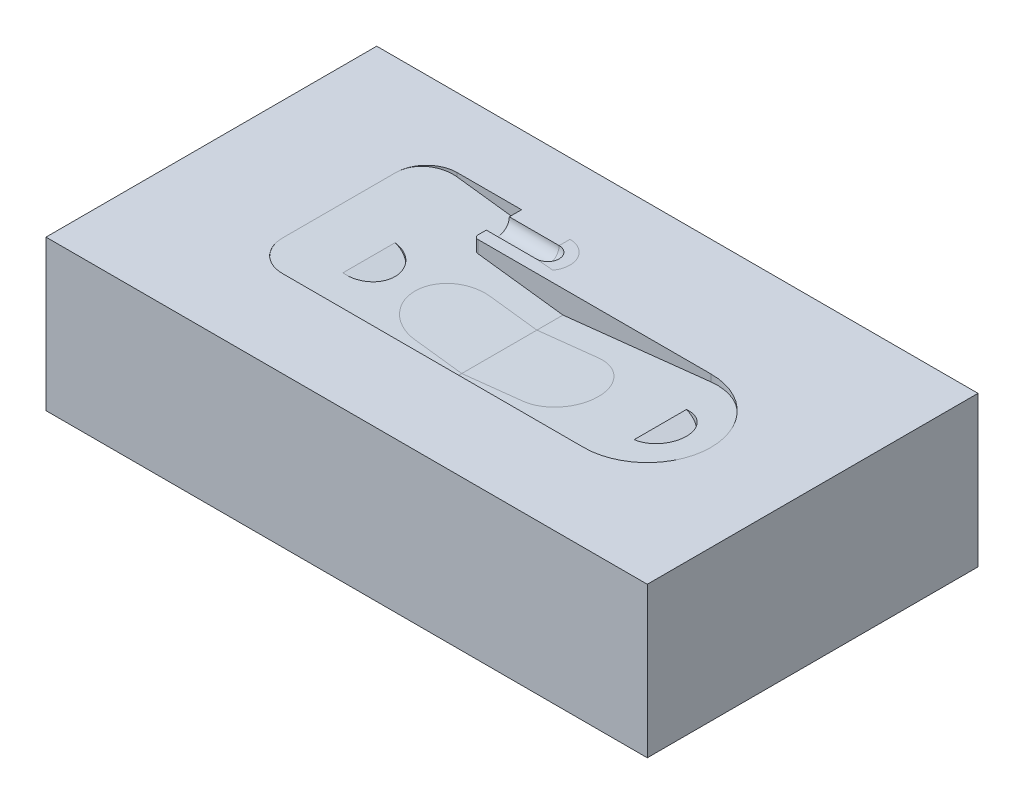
ISO-10303-21;
HEADER;
FILE_DESCRIPTION(('STEP AP214'),'2;1');
FILE_NAME('part.step','',(''),(''),'','','');
FILE_SCHEMA(('AUTOMOTIVE_DESIGN { 1 0 10303 214 1 1 1 1 }'));
ENDSEC;
DATA;
#1=APPLICATION_CONTEXT('core data for automotive mechanical design processes');
#2=APPLICATION_PROTOCOL_DEFINITION('international standard','automotive_design',2000,#1);
#3=PRODUCT_CONTEXT('',#1,'mechanical');
#4=PRODUCT('Part','Part','',(#3));
#5=PRODUCT_RELATED_PRODUCT_CATEGORY('part','',(#4));
#6=PRODUCT_DEFINITION_FORMATION('','',#4);
#7=PRODUCT_DEFINITION_CONTEXT('part definition',#1,'design');
#8=PRODUCT_DEFINITION('design','',#6,#7);
#9=PRODUCT_DEFINITION_SHAPE('','',#8);
#10=(LENGTH_UNIT() NAMED_UNIT(*) SI_UNIT(.MILLI.,.METRE.));
#11=(NAMED_UNIT(*) PLANE_ANGLE_UNIT() SI_UNIT($,.RADIAN.));
#12=(NAMED_UNIT(*) SI_UNIT($,.STERADIAN.) SOLID_ANGLE_UNIT());
#13=UNCERTAINTY_MEASURE_WITH_UNIT(LENGTH_MEASURE(1.E-05),#10,'distance_accuracy_value','');
#14=(GEOMETRIC_REPRESENTATION_CONTEXT(3) GLOBAL_UNCERTAINTY_ASSIGNED_CONTEXT((#13)) GLOBAL_UNIT_ASSIGNED_CONTEXT((#10,
#11,#12)) REPRESENTATION_CONTEXT('',''));
#15=CARTESIAN_POINT('',(0.,0.,0.));
#16=DIRECTION('',(0.,0.,1.));
#17=DIRECTION('',(1.,0.,0.));
#18=AXIS2_PLACEMENT_3D('',#15,#16,#17);
#19=CARTESIAN_POINT('',(0.867000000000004,-10.3658695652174,38.9801952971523));
#20=DIRECTION('',(0.352958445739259,0.935638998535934,0.));
#21=DIRECTION('',(-0.935638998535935,0.352958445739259,0.));
#22=AXIS2_PLACEMENT_3D('',#19,#20,#21);
#23=PLANE('',#22);
#24=CARTESIAN_POINT('',(0.867000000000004,-10.3658695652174,0.));
#25=DIRECTION('',(0.352958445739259,0.935638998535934,0.));
#26=DIRECTION('',(0.935638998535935,-0.352958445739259,0.));
#27=AXIS2_PLACEMENT_3D('',#24,#25,#26);
#28=ELLIPSE('',#27,1.85327888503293,1.734);
#29=CARTESIAN_POINT('',(0.867000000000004,-10.3658695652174,1.73400000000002));
#30=VERTEX_POINT('',#29);
#31=CARTESIAN_POINT('',(0.867000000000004,-10.3658695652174,-1.73399999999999));
#32=VERTEX_POINT('',#31);
#33=EDGE_CURVE('E400',#30,#32,#28,.T.);
#34=ORIENTED_EDGE('',*,*,#33,.T.);
#35=DIRECTION('',(0.,0.,-1.));
#36=VECTOR('',#35,1.);
#37=CARTESIAN_POINT('',(0.867000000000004,-10.3658695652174,38.9801952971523));
#38=LINE('',#37,#36);
#39=EDGE_CURVE('E397',#30,#32,#38,.T.);
#40=ORIENTED_EDGE('',*,*,#39,.F.);
#41=EDGE_LOOP('',(#34,#40));
#42=FACE_BOUND('',#41,.T.);
#43=ADVANCED_FACE('F30',(#42),#23,.T.);
#44=CARTESIAN_POINT('',(0.867000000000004,-7.96,0.));
#45=DIRECTION('',(0.,-1.,0.));
#46=DIRECTION('',(0.,0.,-1.));
#47=AXIS2_PLACEMENT_3D('',#44,#45,#46);
#48=CYLINDRICAL_SURFACE('',#47,1.734);
#49=CARTESIAN_POINT('',(0.867000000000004,-10.3658695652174,0.));
#50=DIRECTION('',(0.108059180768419,-0.994144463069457,0.));
#51=DIRECTION('',(-0.994144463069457,-0.108059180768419,0.));
#52=AXIS2_PLACEMENT_3D('',#49,#50,#51);
#53=ELLIPSE('',#52,1.74421330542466,1.734);
#54=EDGE_CURVE('E377',#30,#32,#53,.F.);
#55=ORIENTED_EDGE('',*,*,#54,.T.);
#56=ORIENTED_EDGE('',*,*,#33,.F.);
#57=EDGE_LOOP('',(#55,#56));
#58=FACE_BOUND('',#57,.T.);
#59=ADVANCED_FACE('F760',(#58),#48,.F.);
#60=CARTESIAN_POINT('',(-18.513,-7.96,0.));
#61=DIRECTION('',(0.,-1.,0.));
#62=DIRECTION('',(0.,0.,-1.));
#63=AXIS2_PLACEMENT_3D('',#60,#61,#62);
#64=CYLINDRICAL_SURFACE('',#63,1.734);
#65=CARTESIAN_POINT('',(-18.513,-10.44625,0.));
#66=DIRECTION('',(-0.124034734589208,-0.992277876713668,0.));
#67=DIRECTION('',(0.992277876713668,-0.124034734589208,0.));
#68=AXIS2_PLACEMENT_3D('',#65,#66,#67);
#69=ELLIPSE('',#68,1.74749436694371,1.734);
#70=CARTESIAN_POINT('',(-18.513,-10.44625,1.734));
#71=VERTEX_POINT('',#70);
#72=CARTESIAN_POINT('',(-18.513,-10.44625,-1.73399999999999));
#73=VERTEX_POINT('',#72);
#74=EDGE_CURVE('E369',#71,#73,#69,.F.);
#75=ORIENTED_EDGE('',*,*,#74,.T.);
#76=CARTESIAN_POINT('',(-18.513,-10.44625,0.));
#77=DIRECTION('',(-0.314132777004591,-0.949379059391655,0.));
#78=DIRECTION('',(0.949379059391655,-0.314132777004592,0.));
#79=AXIS2_PLACEMENT_3D('',#76,#77,#78);
#80=ELLIPSE('',#79,1.82645696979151,1.734);
#81=EDGE_CURVE('E420',#73,#71,#80,.T.);
#82=ORIENTED_EDGE('',*,*,#81,.T.);
#83=EDGE_LOOP('',(#75,#82));
#84=FACE_BOUND('',#83,.T.);
#85=ADVANCED_FACE('F757',(#84),#64,.F.);
#86=CARTESIAN_POINT('',(-16.779,-11.02,38.4064452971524));
#87=DIRECTION('',(-0.314132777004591,-0.949379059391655,0.));
#88=DIRECTION('',(0.949379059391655,-0.314132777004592,0.));
#89=AXIS2_PLACEMENT_3D('',#86,#87,#88);
#90=PLANE('',#89);
#91=ORIENTED_EDGE('',*,*,#81,.F.);
#92=DIRECTION('',(0.,0.,-1.));
#93=VECTOR('',#92,1.);
#94=CARTESIAN_POINT('',(-18.513,-10.44625,38.4064452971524));
#95=LINE('',#94,#93);
#96=EDGE_CURVE('E159',#71,#73,#95,.T.);
#97=ORIENTED_EDGE('',*,*,#96,.F.);
#98=EDGE_LOOP('',(#91,#97));
#99=FACE_BOUND('',#98,.T.);
#100=ADVANCED_FACE('F753',(#99),#90,.F.);
#101=CARTESIAN_POINT('',(-15.504,-8.47,-4.488));
#102=DIRECTION('',(0.,-1.,0.));
#103=DIRECTION('',(0.,0.,-1.));
#104=AXIS2_PLACEMENT_3D('',#101,#102,#103);
#105=CYLINDRICAL_SURFACE('',#104,0.255);
#106=CARTESIAN_POINT('',(-15.504,-10.,-4.488));
#107=DIRECTION('',(0.,-1.,0.));
#108=DIRECTION('',(0.,0.,1.));
#109=AXIS2_PLACEMENT_3D('',#106,#107,#108);
#110=CIRCLE('',#109,0.255);
#111=CARTESIAN_POINT('',(-15.504,-10.,-4.233));
#112=VERTEX_POINT('',#111);
#113=CARTESIAN_POINT('',(-15.759,-10.,-4.488));
#114=VERTEX_POINT('',#113);
#115=EDGE_CURVE('E431',#112,#114,#110,.T.);
#116=ORIENTED_EDGE('',*,*,#115,.T.);
#117=DIRECTION('',(0.,-1.,0.));
#118=VECTOR('',#117,1.);
#119=CARTESIAN_POINT('',(-15.759,-8.47,-4.488));
#120=LINE('',#119,#118);
#121=CARTESIAN_POINT('',(-15.759,-10.7905,-4.488));
#122=VERTEX_POINT('',#121);
#123=EDGE_CURVE('E447',#114,#122,#120,.T.);
#124=ORIENTED_EDGE('',*,*,#123,.T.);
#125=CARTESIAN_POINT('',(-15.504,-10.822375,-4.488));
#126=DIRECTION('',(-0.124034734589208,-0.992277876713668,0.));
#127=DIRECTION('',(0.992277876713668,-0.124034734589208,0.));
#128=AXIS2_PLACEMENT_3D('',#125,#126,#127);
#129=ELLIPSE('',#128,0.256984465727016,0.255);
#130=CARTESIAN_POINT('',(-15.504,-10.822375,-4.233));
#131=VERTEX_POINT('',#130);
#132=EDGE_CURVE('E374',#122,#131,#129,.F.);
#133=ORIENTED_EDGE('',*,*,#132,.T.);
#134=DIRECTION('',(0.,-1.,0.));
#135=VECTOR('',#134,1.);
#136=CARTESIAN_POINT('',(-15.504,-8.47,-4.233));
#137=LINE('',#136,#135);
#138=EDGE_CURVE('E419',#112,#131,#137,.T.);
#139=ORIENTED_EDGE('',*,*,#138,.F.);
#140=EDGE_LOOP('',(#116,#124,#133,#139));
#141=FACE_BOUND('',#140,.T.);
#142=ADVANCED_FACE('F750',(#141),#105,.T.);
#143=CARTESIAN_POINT('',(-12.444,-10.,-5.814));
#144=DIRECTION('',(0.,0.,1.));
#145=DIRECTION('',(1.,0.,0.));
#146=AXIS2_PLACEMENT_3D('',#143,#144,#145);
#147=SPHERICAL_SURFACE('',#146,0.765);
#148=CARTESIAN_POINT('',(-12.444,-10.,-5.814));
#149=DIRECTION('',(-1.,0.,0.));
#150=DIRECTION('',(0.,0.,1.));
#151=AXIS2_PLACEMENT_3D('',#148,#149,#150);
#152=CIRCLE('',#151,0.765000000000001);
#153=CARTESIAN_POINT('',(-12.444,-10.,-6.579));
#154=VERTEX_POINT('',#153);
#155=CARTESIAN_POINT('',(-12.444,-10.,-5.049));
#156=VERTEX_POINT('',#155);
#157=EDGE_CURVE('E451',#154,#156,#152,.T.);
#158=ORIENTED_EDGE('',*,*,#157,.T.);
#159=CARTESIAN_POINT('',(-12.444,-10.,-5.814));
#160=DIRECTION('',(0.,-1.,0.));
#161=DIRECTION('',(0.,0.,-1.));
#162=AXIS2_PLACEMENT_3D('',#159,#160,#161);
#163=CIRCLE('',#162,0.765);
#164=EDGE_CURVE('E50',#154,#156,#163,.T.);
#165=ORIENTED_EDGE('',*,*,#164,.F.);
#166=EDGE_LOOP('',(#158,#165));
#167=FACE_BOUND('',#166,.T.);
#168=ADVANCED_FACE('F747',(#167),#147,.F.);
#169=CARTESIAN_POINT('',(-11.679,-10.,-5.814));
#170=DIRECTION('',(-1.,0.,0.));
#171=DIRECTION('',(0.,0.,1.));
#172=AXIS2_PLACEMENT_3D('',#169,#170,#171);
#173=CYLINDRICAL_SURFACE('',#172,0.765000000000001);
#174=DIRECTION('',(1.,0.,0.));
#175=VECTOR('',#174,1.);
#176=CARTESIAN_POINT('',(-11.679,-10.,-5.049));
#177=LINE('',#176,#175);
#178=CARTESIAN_POINT('',(-15.759,-10.,-5.049));
#179=VERTEX_POINT('',#178);
#180=EDGE_CURVE('E65',#179,#156,#177,.T.);
#181=ORIENTED_EDGE('',*,*,#180,.T.);
#182=ORIENTED_EDGE('',*,*,#157,.F.);
#183=DIRECTION('',(-1.,0.,0.));
#184=VECTOR('',#183,1.);
#185=CARTESIAN_POINT('',(-11.679,-10.,-6.579));
#186=LINE('',#185,#184);
#187=CARTESIAN_POINT('',(-15.759,-10.,-6.579));
#188=VERTEX_POINT('',#187);
#189=EDGE_CURVE('E454',#154,#188,#186,.T.);
#190=ORIENTED_EDGE('',*,*,#189,.T.);
#191=CARTESIAN_POINT('',(-15.759,-10.,-5.814));
#192=DIRECTION('',(-1.,0.,0.));
#193=DIRECTION('',(0.,0.,1.));
#194=AXIS2_PLACEMENT_3D('',#191,#192,#193);
#195=CIRCLE('',#194,0.765000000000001);
#196=EDGE_CURVE('E460',#179,#188,#195,.F.);
#197=ORIENTED_EDGE('',*,*,#196,.F.);
#198=EDGE_LOOP('',(#181,#182,#190,#197));
#199=FACE_BOUND('',#198,.T.);
#200=ADVANCED_FACE('F744',(#199),#173,.F.);
#201=CARTESIAN_POINT('',(-15.759,-8.47,-7.395));
#202=DIRECTION('',(-1.,0.,0.));
#203=DIRECTION('',(0.,0.,1.));
#204=AXIS2_PLACEMENT_3D('',#201,#202,#203);
#205=PLANE('',#204);
#206=DIRECTION('',(0.,0.,-1.));
#207=VECTOR('',#206,1.);
#208=CARTESIAN_POINT('',(-15.759,-10.,-7.395));
#209=LINE('',#208,#207);
#210=CARTESIAN_POINT('',(-15.759,-10.,-7.395));
#211=VERTEX_POINT('',#210);
#212=EDGE_CURVE('E86',#188,#211,#209,.T.);
#213=ORIENTED_EDGE('',*,*,#212,.T.);
#214=DIRECTION('',(0.,-1.,0.));
#215=VECTOR('',#214,1.);
#216=CARTESIAN_POINT('',(-15.759,-8.47,-7.395));
#217=LINE('',#216,#215);
#218=CARTESIAN_POINT('',(-15.759,-10.7905,-7.395));
#219=VERTEX_POINT('',#218);
#220=EDGE_CURVE('E450',#211,#219,#217,.T.);
#221=ORIENTED_EDGE('',*,*,#220,.T.);
#222=DIRECTION('',(0.,0.,1.));
#223=VECTOR('',#222,1.);
#224=CARTESIAN_POINT('',(-15.759,-10.7905,-7.395));
#225=LINE('',#224,#223);
#226=EDGE_CURVE('E165',#219,#122,#225,.T.);
#227=ORIENTED_EDGE('',*,*,#226,.T.);
#228=ORIENTED_EDGE('',*,*,#123,.F.);
#229=DIRECTION('',(0.,0.,-1.));
#230=VECTOR('',#229,1.);
#231=CARTESIAN_POINT('',(-15.759,-10.,-7.395));
#232=LINE('',#231,#230);
#233=EDGE_CURVE('E77',#114,#179,#232,.T.);
#234=ORIENTED_EDGE('',*,*,#233,.T.);
#235=ORIENTED_EDGE('',*,*,#196,.T.);
#236=EDGE_LOOP('',(#213,#221,#227,#228,#234,#235));
#237=FACE_BOUND('',#236,.T.);
#238=ADVANCED_FACE('F741',(#237),#205,.T.);
#239=CARTESIAN_POINT('',(-20.043,-8.47,-7.395));
#240=DIRECTION('',(0.,0.,1.));
#241=DIRECTION('',(1.,0.,0.));
#242=AXIS2_PLACEMENT_3D('',#239,#240,#241);
#243=PLANE('',#242);
#244=DIRECTION('',(-1.,0.,0.));
#245=VECTOR('',#244,1.);
#246=CARTESIAN_POINT('',(-20.043,-10.,-7.395));
#247=LINE('',#246,#245);
#248=CARTESIAN_POINT('',(-20.043,-10.,-7.395));
#249=VERTEX_POINT('',#248);
#250=EDGE_CURVE('E93',#211,#249,#247,.T.);
#251=ORIENTED_EDGE('',*,*,#250,.T.);
#252=DIRECTION('',(0.,-1.,0.));
#253=VECTOR('',#252,1.);
#254=CARTESIAN_POINT('',(-20.043,-8.47,-7.395));
#255=LINE('',#254,#253);
#256=CARTESIAN_POINT('',(-20.043,-10.255,-7.395));
#257=VERTEX_POINT('',#256);
#258=EDGE_CURVE('E479',#249,#257,#255,.T.);
#259=ORIENTED_EDGE('',*,*,#258,.T.);
#260=DIRECTION('',(0.992277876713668,-0.124034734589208,0.));
#261=VECTOR('',#260,1.);
#262=CARTESIAN_POINT('',(-9.843,-11.53,-7.395));
#263=LINE('',#262,#261);
#264=EDGE_CURVE('E412',#257,#219,#263,.T.);
#265=ORIENTED_EDGE('',*,*,#264,.T.);
#266=ORIENTED_EDGE('',*,*,#220,.F.);
#267=EDGE_LOOP('',(#251,#259,#265,#266));
#268=FACE_BOUND('',#267,.T.);
#269=ADVANCED_FACE('F738',(#268),#243,.T.);
#270=CARTESIAN_POINT('',(-20.043,-8.47,-5.355));
#271=DIRECTION('',(0.,-1.,0.));
#272=DIRECTION('',(0.,0.,-1.));
#273=AXIS2_PLACEMENT_3D('',#270,#271,#272);
#274=CYLINDRICAL_SURFACE('',#273,2.04);
#275=CARTESIAN_POINT('',(-20.043,-10.,-5.355));
#276=DIRECTION('',(0.,-1.,0.));
#277=DIRECTION('',(0.,0.,-1.));
#278=AXIS2_PLACEMENT_3D('',#275,#276,#277);
#279=CIRCLE('',#278,2.04);
#280=CARTESIAN_POINT('',(-22.083,-10.,-5.355));
#281=VERTEX_POINT('',#280);
#282=EDGE_CURVE('E101',#249,#281,#279,.F.);
#283=ORIENTED_EDGE('',*,*,#282,.T.);
#284=CARTESIAN_POINT('',(-20.043,-10.255,-5.355));
#285=DIRECTION('',(-0.124034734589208,-0.992277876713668,0.));
#286=DIRECTION('',(0.992277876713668,-0.124034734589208,0.));
#287=AXIS2_PLACEMENT_3D('',#284,#285,#286);
#288=ELLIPSE('',#287,2.05587572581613,2.04);
#289=EDGE_CURVE('E414',#281,#257,#288,.T.);
#290=ORIENTED_EDGE('',*,*,#289,.T.);
#291=ORIENTED_EDGE('',*,*,#258,.F.);
#292=EDGE_LOOP('',(#283,#290,#291));
#293=FACE_BOUND('',#292,.T.);
#294=ADVANCED_FACE('F735',(#293),#274,.F.);
#295=CARTESIAN_POINT('',(0.,-8.47,0.));
#296=DIRECTION('',(0.,-1.,0.));
#297=DIRECTION('',(0.,0.,-1.));
#298=AXIS2_PLACEMENT_3D('',#295,#296,#297);
#299=CYLINDRICAL_SURFACE('',#298,4.233);
#300=CARTESIAN_POINT('',(0.,-10.,0.));
#301=DIRECTION('',(0.,-1.,0.));
#302=DIRECTION('',(0.,0.,-1.));
#303=AXIS2_PLACEMENT_3D('',#300,#301,#302);
#304=CIRCLE('',#303,4.233);
#305=CARTESIAN_POINT('',(0.,-10.,4.233));
#306=VERTEX_POINT('',#305);
#307=CARTESIAN_POINT('',(4.233,-10.,0.));
#308=VERTEX_POINT('',#307);
#309=EDGE_CURVE('E408',#306,#308,#304,.F.);
#310=ORIENTED_EDGE('',*,*,#309,.T.);
#311=CARTESIAN_POINT('',(0.,-10.4601086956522,0.));
#312=DIRECTION('',(0.108059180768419,-0.994144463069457,0.));
#313=DIRECTION('',(-0.994144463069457,-0.108059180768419,0.));
#314=AXIS2_PLACEMENT_3D('',#311,#312,#313);
#315=ELLIPSE('',#314,4.25793248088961,4.233);
#316=CARTESIAN_POINT('',(0.,-10.4601086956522,4.233));
#317=VERTEX_POINT('',#316);
#318=EDGE_CURVE('E375',#308,#317,#315,.T.);
#319=ORIENTED_EDGE('',*,*,#318,.T.);
#320=DIRECTION('',(0.,-1.,0.));
#321=VECTOR('',#320,1.);
#322=CARTESIAN_POINT('',(0.,-8.47,4.233));
#323=LINE('',#322,#321);
#324=EDGE_CURVE('E483',#306,#317,#323,.T.);
#325=ORIENTED_EDGE('',*,*,#324,.F.);
#326=EDGE_LOOP('',(#310,#319,#325));
#327=FACE_BOUND('',#326,.T.);
#328=ADVANCED_FACE('F719',(#327),#299,.F.);
#329=CARTESIAN_POINT('',(-20.043,-8.47,2.193));
#330=DIRECTION('',(0.,-1.,0.));
#331=DIRECTION('',(0.,0.,-1.));
#332=AXIS2_PLACEMENT_3D('',#329,#330,#331);
#333=CYLINDRICAL_SURFACE('',#332,2.04);
#334=CARTESIAN_POINT('',(-20.043,-10.,2.193));
#335=DIRECTION('',(0.,-1.,0.));
#336=DIRECTION('',(0.,0.,-1.));
#337=AXIS2_PLACEMENT_3D('',#334,#335,#336);
#338=CIRCLE('',#337,2.04);
#339=CARTESIAN_POINT('',(-22.083,-10.,2.193));
#340=VERTEX_POINT('',#339);
#341=CARTESIAN_POINT('',(-20.043,-10.,4.233));
#342=VERTEX_POINT('',#341);
#343=EDGE_CURVE('E42',#340,#342,#338,.F.);
#344=ORIENTED_EDGE('',*,*,#343,.T.);
#345=DIRECTION('',(0.,-1.,0.));
#346=VECTOR('',#345,1.);
#347=CARTESIAN_POINT('',(-20.043,-8.47,4.233));
#348=LINE('',#347,#346);
#349=CARTESIAN_POINT('',(-20.043,-10.255,4.233));
#350=VERTEX_POINT('',#349);
#351=EDGE_CURVE('E411',#342,#350,#348,.T.);
#352=ORIENTED_EDGE('',*,*,#351,.T.);
#353=CARTESIAN_POINT('',(-20.043,-10.255,2.193));
#354=DIRECTION('',(-0.124034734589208,-0.992277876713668,0.));
#355=DIRECTION('',(0.992277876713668,-0.124034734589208,0.));
#356=AXIS2_PLACEMENT_3D('',#353,#354,#355);
#357=ELLIPSE('',#356,2.05587572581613,2.04);
#358=EDGE_CURVE('E487',#350,#340,#357,.T.);
#359=ORIENTED_EDGE('',*,*,#358,.T.);
#360=EDGE_LOOP('',(#344,#352,#359));
#361=FACE_BOUND('',#360,.T.);
#362=ADVANCED_FACE('F730',(#361),#333,.F.);
#363=CARTESIAN_POINT('',(-20.043,-8.47,4.233));
#364=DIRECTION('',(0.,0.,-1.));
#365=DIRECTION('',(-1.,0.,0.));
#366=AXIS2_PLACEMENT_3D('',#363,#364,#365);
#367=PLANE('',#366);
#368=DIRECTION('',(1.,0.,0.));
#369=VECTOR('',#368,1.);
#370=CARTESIAN_POINT('',(-20.043,-10.,4.233));
#371=LINE('',#370,#369);
#372=EDGE_CURVE('E11',#342,#306,#371,.T.);
#373=ORIENTED_EDGE('',*,*,#372,.T.);
#374=ORIENTED_EDGE('',*,*,#324,.T.);
#375=DIRECTION('',(0.994144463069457,0.108059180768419,0.));
#376=VECTOR('',#375,1.);
#377=CARTESIAN_POINT('',(-9.843,-11.53,4.233));
#378=LINE('',#377,#376);
#379=CARTESIAN_POINT('',(-9.843,-11.53,4.233));
#380=VERTEX_POINT('',#379);
#381=EDGE_CURVE('E386',#380,#317,#378,.T.);
#382=ORIENTED_EDGE('',*,*,#381,.F.);
#383=DIRECTION('',(0.992277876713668,-0.124034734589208,0.));
#384=VECTOR('',#383,1.);
#385=CARTESIAN_POINT('',(-9.843,-11.53,4.233));
#386=LINE('',#385,#384);
#387=EDGE_CURVE('E389',#350,#380,#386,.T.);
#388=ORIENTED_EDGE('',*,*,#387,.F.);
#389=ORIENTED_EDGE('',*,*,#351,.F.);
#390=EDGE_LOOP('',(#373,#374,#382,#388,#389));
#391=FACE_BOUND('',#390,.T.);
#392=ADVANCED_FACE('F726',(#391),#367,.T.);
#393=CARTESIAN_POINT('',(-9.843,-11.53,-7.395));
#394=DIRECTION('',(-0.124034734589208,-0.992277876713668,0.));
#395=DIRECTION('',(0.992277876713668,-0.124034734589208,0.));
#396=AXIS2_PLACEMENT_3D('',#393,#394,#395);
#397=PLANE('',#396);
#398=DIRECTION('',(0.992277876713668,-0.124034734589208,0.));
#399=VECTOR('',#398,1.);
#400=CARTESIAN_POINT('',(-9.843,-11.53,-2.5));
#401=LINE('',#400,#399);
#402=CARTESIAN_POINT('',(-12.95,-11.141625,-2.5));
#403=VERTEX_POINT('',#402);
#404=CARTESIAN_POINT('',(-9.843,-11.53,-2.5));
#405=VERTEX_POINT('',#404);
#406=EDGE_CURVE('E364',#403,#405,#401,.T.);
#407=ORIENTED_EDGE('',*,*,#406,.T.);
#408=DIRECTION('',(0.,0.,1.));
#409=VECTOR('',#408,1.);
#410=CARTESIAN_POINT('',(-9.843,-11.53,-7.395));
#411=LINE('',#410,#409);
#412=CARTESIAN_POINT('',(-9.843,-11.53,-4.233));
#413=VERTEX_POINT('',#412);
#414=EDGE_CURVE('E373',#413,#405,#411,.T.);
#415=ORIENTED_EDGE('',*,*,#414,.F.);
#416=DIRECTION('',(0.992277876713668,-0.124034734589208,0.));
#417=VECTOR('',#416,1.);
#418=CARTESIAN_POINT('',(-15.7935230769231,-10.7861846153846,-4.233));
#419=LINE('',#418,#417);
#420=EDGE_CURVE('E370',#131,#413,#419,.T.);
#421=ORIENTED_EDGE('',*,*,#420,.F.);
#422=ORIENTED_EDGE('',*,*,#132,.F.);
#423=ORIENTED_EDGE('',*,*,#226,.F.);
#424=ORIENTED_EDGE('',*,*,#264,.F.);
#425=ORIENTED_EDGE('',*,*,#289,.F.);
#426=DIRECTION('',(0.,0.,1.));
#427=VECTOR('',#426,1.);
#428=CARTESIAN_POINT('',(-22.083,-10.,-7.395));
#429=LINE('',#428,#427);
#430=EDGE_CURVE('E484',#281,#340,#429,.T.);
#431=ORIENTED_EDGE('',*,*,#430,.T.);
#432=ORIENTED_EDGE('',*,*,#358,.F.);
#433=ORIENTED_EDGE('',*,*,#387,.T.);
#434=CARTESIAN_POINT('',(-9.843,-11.53,2.5));
#435=VERTEX_POINT('',#434);
#436=EDGE_CURVE('E385',#435,#380,#411,.T.);
#437=ORIENTED_EDGE('',*,*,#436,.F.);
#438=DIRECTION('',(-0.992277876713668,0.124034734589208,0.));
#439=VECTOR('',#438,1.);
#440=CARTESIAN_POINT('',(-9.843,-11.53,2.5));
#441=LINE('',#440,#439);
#442=CARTESIAN_POINT('',(-12.95,-11.141625,2.5));
#443=VERTEX_POINT('',#442);
#444=EDGE_CURVE('E363',#435,#443,#441,.T.);
#445=ORIENTED_EDGE('',*,*,#444,.T.);
#446=CARTESIAN_POINT('',(-12.95,-11.141625,0.));
#447=DIRECTION('',(-0.124034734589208,-0.992277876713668,0.));
#448=DIRECTION('',(-0.992277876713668,0.124034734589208,0.));
#449=AXIS2_PLACEMENT_3D('',#446,#447,#448);
#450=ELLIPSE('',#449,2.5194555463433,2.5);
#451=EDGE_CURVE('E393',#443,#403,#450,.T.);
#452=ORIENTED_EDGE('',*,*,#451,.T.);
#453=EDGE_LOOP('',(#407,#415,#421,#422,#423,#424,#425,#431,#432,#433,#437,#445,#452));
#454=FACE_BOUND('',#453,.T.);
#455=ORIENTED_EDGE('',*,*,#96,.T.);
#456=ORIENTED_EDGE('',*,*,#74,.F.);
#457=EDGE_LOOP('',(#455,#456));
#458=FACE_BOUND('',#457,.T.);
#459=ADVANCED_FACE('F722',(#454,#458),#397,.F.);
#460=CARTESIAN_POINT('',(-9.843,-11.53,-7.395));
#461=DIRECTION('',(0.108059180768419,-0.994144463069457,0.));
#462=DIRECTION('',(0.994144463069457,0.108059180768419,0.));
#463=AXIS2_PLACEMENT_3D('',#460,#461,#462);
#464=PLANE('',#463);
#465=DIRECTION('',(0.994144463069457,0.108059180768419,0.));
#466=VECTOR('',#465,1.);
#467=CARTESIAN_POINT('',(-9.843,-11.53,-2.5));
#468=LINE('',#467,#466);
#469=CARTESIAN_POINT('',(-5.75,-11.0851086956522,-2.5));
#470=VERTEX_POINT('',#469);
#471=EDGE_CURVE('E378',#405,#470,#468,.T.);
#472=ORIENTED_EDGE('',*,*,#471,.T.);
#473=CARTESIAN_POINT('',(-5.75,-11.0851086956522,0.));
#474=DIRECTION('',(0.108059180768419,-0.994144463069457,0.));
#475=DIRECTION('',(0.994144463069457,0.108059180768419,0.));
#476=AXIS2_PLACEMENT_3D('',#473,#474,#475);
#477=ELLIPSE('',#476,2.51472506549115,2.5);
#478=CARTESIAN_POINT('',(-5.75,-11.0851086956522,2.5));
#479=VERTEX_POINT('',#478);
#480=EDGE_CURVE('E381',#470,#479,#477,.T.);
#481=ORIENTED_EDGE('',*,*,#480,.T.);
#482=DIRECTION('',(-0.994144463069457,-0.108059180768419,0.));
#483=VECTOR('',#482,1.);
#484=CARTESIAN_POINT('',(-9.843,-11.53,2.5));
#485=LINE('',#484,#483);
#486=EDGE_CURVE('E390',#479,#435,#485,.T.);
#487=ORIENTED_EDGE('',*,*,#486,.T.);
#488=ORIENTED_EDGE('',*,*,#436,.T.);
#489=ORIENTED_EDGE('',*,*,#381,.T.);
#490=ORIENTED_EDGE('',*,*,#318,.F.);
#491=CARTESIAN_POINT('',(0.,-10.4601086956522,-4.233));
#492=VERTEX_POINT('',#491);
#493=EDGE_CURVE('E368',#492,#308,#315,.T.);
#494=ORIENTED_EDGE('',*,*,#493,.F.);
#495=DIRECTION('',(0.994144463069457,0.108059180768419,0.));
#496=VECTOR('',#495,1.);
#497=CARTESIAN_POINT('',(-15.1091728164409,-12.1024100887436,-4.233));
#498=LINE('',#497,#496);
#499=EDGE_CURVE('E365',#413,#492,#498,.T.);
#500=ORIENTED_EDGE('',*,*,#499,.F.);
#501=ORIENTED_EDGE('',*,*,#414,.T.);
#502=EDGE_LOOP('',(#472,#481,#487,#488,#489,#490,#494,#500,#501));
#503=FACE_BOUND('',#502,.T.);
#504=ORIENTED_EDGE('',*,*,#54,.F.);
#505=ORIENTED_EDGE('',*,*,#39,.T.);
#506=EDGE_LOOP('',(#504,#505));
#507=FACE_BOUND('',#506,.T.);
#508=ADVANCED_FACE('F717',(#503,#507),#464,.F.);
#509=CARTESIAN_POINT('',(0.,-10.,0.));
#510=DIRECTION('',(0.,-1.,0.));
#511=DIRECTION('',(0.,0.,-1.));
#512=AXIS2_PLACEMENT_3D('',#509,#510,#511);
#513=CIRCLE('',#512,4.233);
#514=CARTESIAN_POINT('',(0.,-10.,-4.233));
#515=VERTEX_POINT('',#514);
#516=EDGE_CURVE('E432',#308,#515,#513,.F.);
#517=ORIENTED_EDGE('',*,*,#516,.T.);
#518=DIRECTION('',(0.,-1.,0.));
#519=VECTOR('',#518,1.);
#520=CARTESIAN_POINT('',(0.,-8.47,-4.233));
#521=LINE('',#520,#519);
#522=EDGE_CURVE('E382',#515,#492,#521,.T.);
#523=ORIENTED_EDGE('',*,*,#522,.T.);
#524=ORIENTED_EDGE('',*,*,#493,.T.);
#525=EDGE_LOOP('',(#517,#523,#524));
#526=FACE_BOUND('',#525,.T.);
#527=ADVANCED_FACE('F713',(#526),#299,.F.);
#528=CARTESIAN_POINT('',(-15.504,-8.47,-4.233));
#529=DIRECTION('',(0.,0.,1.));
#530=DIRECTION('',(1.,0.,0.));
#531=AXIS2_PLACEMENT_3D('',#528,#529,#530);
#532=PLANE('',#531);
#533=DIRECTION('',(-1.,0.,0.));
#534=VECTOR('',#533,1.);
#535=CARTESIAN_POINT('',(-15.504,-10.,-4.233));
#536=LINE('',#535,#534);
#537=EDGE_CURVE('E427',#515,#112,#536,.T.);
#538=ORIENTED_EDGE('',*,*,#537,.T.);
#539=ORIENTED_EDGE('',*,*,#138,.T.);
#540=ORIENTED_EDGE('',*,*,#420,.T.);
#541=ORIENTED_EDGE('',*,*,#499,.T.);
#542=ORIENTED_EDGE('',*,*,#522,.F.);
#543=EDGE_LOOP('',(#538,#539,#540,#541,#542));
#544=FACE_BOUND('',#543,.T.);
#545=ADVANCED_FACE('F709',(#544),#532,.T.);
#546=CARTESIAN_POINT('',(-9.843,-11.53,-7.395));
#547=DIRECTION('',(0.108059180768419,-0.994144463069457,0.));
#548=DIRECTION('',(0.994144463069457,0.108059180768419,0.));
#549=AXIS2_PLACEMENT_3D('',#546,#547,#548);
#550=PLANE('',#549);
#551=DIRECTION('',(0.,0.,1.));
#552=VECTOR('',#551,1.);
#553=CARTESIAN_POINT('',(-9.843,-11.53,-7.395));
#554=LINE('',#553,#552);
#555=EDGE_CURVE('E360',#405,#435,#554,.T.);
#556=ORIENTED_EDGE('',*,*,#555,.T.);
#557=ORIENTED_EDGE('',*,*,#486,.F.);
#558=ORIENTED_EDGE('',*,*,#480,.F.);
#559=ORIENTED_EDGE('',*,*,#471,.F.);
#560=EDGE_LOOP('',(#556,#557,#558,#559));
#561=FACE_BOUND('',#560,.T.);
#562=ADVANCED_FACE('F705',(#561),#550,.F.);
#563=CARTESIAN_POINT('',(-9.843,-11.53,-7.395));
#564=DIRECTION('',(-0.124034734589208,-0.992277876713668,0.));
#565=DIRECTION('',(0.992277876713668,-0.124034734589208,0.));
#566=AXIS2_PLACEMENT_3D('',#563,#564,#565);
#567=PLANE('',#566);
#568=ORIENTED_EDGE('',*,*,#451,.F.);
#569=ORIENTED_EDGE('',*,*,#444,.F.);
#570=ORIENTED_EDGE('',*,*,#555,.F.);
#571=ORIENTED_EDGE('',*,*,#406,.F.);
#572=EDGE_LOOP('',(#568,#569,#570,#571));
#573=FACE_BOUND('',#572,.T.);
#574=ADVANCED_FACE('F691',(#573),#567,.F.);
#575=CARTESIAN_POINT('',(0.,-10.,4.233));
#576=DIRECTION('',(0.,-1.,0.));
#577=DIRECTION('',(0.707106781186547,0.,-0.707106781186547));
#578=AXIS2_PLACEMENT_3D('',#575,#576,#577);
#579=PLANE('',#578);
#580=CARTESIAN_POINT('',(-12.444,-10.,-7.299));
#581=CARTESIAN_POINT('',(-12.3743071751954,-10.,-7.29617606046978));
#582=CARTESIAN_POINT('',(-11.8325128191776,-10.,-7.27422265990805));
#583=CARTESIAN_POINT('',(-11.3402534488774,-10.,-6.91423830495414));
#584=CARTESIAN_POINT('',(-10.9064674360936,-10.,-6.07209550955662));
#585=CARTESIAN_POINT('',(-10.9007100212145,-10.,-5.46221551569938));
#586=CARTESIAN_POINT('',(-11.1977209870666,-10.,-5.00866481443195));
#587=CARTESIAN_POINT('',(-11.2341734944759,-10.,-4.953));
#588=B_SPLINE_CURVE_WITH_KNOTS('',3,(#580,#581,#582,#583,#584,#585,#586,#587),.UNSPECIFIED.,.F.,
.F.,(4,1,2,1,4),(0.,0.0643166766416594,0.5,0.938634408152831,1.),.UNSPECIFIED.);
#589=CARTESIAN_POINT('',(-12.444,-10.,-7.299));
#590=VERTEX_POINT('',#589);
#591=CARTESIAN_POINT('',(-11.2341734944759,-10.,-4.953));
#592=VERTEX_POINT('',#591);
#593=EDGE_CURVE('E401',#590,#592,#588,.T.);
#594=ORIENTED_EDGE('',*,*,#593,.T.);
#595=DIRECTION('',(0.996866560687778,0.,0.0791015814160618));
#596=VECTOR('',#595,1.);
#597=CARTESIAN_POINT('',(-11.8390867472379,-10.,-5.001));
#598=LINE('',#597,#596);
#599=EDGE_CURVE('E348',#156,#592,#598,.T.);
#600=ORIENTED_EDGE('',*,*,#599,.F.);
#601=ORIENTED_EDGE('',*,*,#180,.F.);
#602=ORIENTED_EDGE('',*,*,#233,.F.);
#603=ORIENTED_EDGE('',*,*,#115,.F.);
#604=ORIENTED_EDGE('',*,*,#537,.F.);
#605=ORIENTED_EDGE('',*,*,#516,.F.);
#606=ORIENTED_EDGE('',*,*,#309,.F.);
#607=ORIENTED_EDGE('',*,*,#372,.F.);
#608=ORIENTED_EDGE('',*,*,#343,.F.);
#609=ORIENTED_EDGE('',*,*,#430,.F.);
#610=ORIENTED_EDGE('',*,*,#282,.F.);
#611=ORIENTED_EDGE('',*,*,#250,.F.);
#612=ORIENTED_EDGE('',*,*,#212,.F.);
#613=ORIENTED_EDGE('',*,*,#189,.F.);
#614=DIRECTION('',(0.,0.,1.));
#615=VECTOR('',#614,1.);
#616=CARTESIAN_POINT('',(-12.444,-10.,-6.939));
#617=LINE('',#616,#615);
#618=EDGE_CURVE('E357',#590,#154,#617,.T.);
#619=ORIENTED_EDGE('',*,*,#618,.F.);
#620=EDGE_LOOP('',(#594,#600,#601,#602,#603,#604,#605,#606,#607,#608,#609,#610,#611,#612,#613,#619));
#621=FACE_BOUND('',#620,.T.);
#622=DIRECTION('',(0.,0.,1.));
#623=VECTOR('',#622,1.);
#624=CARTESIAN_POINT('',(-30.,-10.,-12.));
#625=LINE('',#624,#623);
#626=CARTESIAN_POINT('',(-30.,-10.,-12.));
#627=VERTEX_POINT('',#626);
#628=CARTESIAN_POINT('',(-30.,-10.,10.));
#629=VERTEX_POINT('',#628);
#630=EDGE_CURVE('E623',#627,#629,#625,.T.);
#631=ORIENTED_EDGE('',*,*,#630,.T.);
#632=DIRECTION('',(1.,0.,0.));
#633=VECTOR('',#632,1.);
#634=CARTESIAN_POINT('',(-30.,-10.,10.));
#635=LINE('',#634,#633);
#636=CARTESIAN_POINT('',(10.,-10.,10.));
#637=VERTEX_POINT('',#636);
#638=EDGE_CURVE('E625',#629,#637,#635,.T.);
#639=ORIENTED_EDGE('',*,*,#638,.T.);
#640=DIRECTION('',(0.,0.,-1.));
#641=VECTOR('',#640,1.);
#642=CARTESIAN_POINT('',(10.,-10.,-12.));
#643=LINE('',#642,#641);
#644=CARTESIAN_POINT('',(10.,-10.,-12.));
#645=VERTEX_POINT('',#644);
#646=EDGE_CURVE('E635',#637,#645,#643,.T.);
#647=ORIENTED_EDGE('',*,*,#646,.T.);
#648=DIRECTION('',(-1.,0.,0.));
#649=VECTOR('',#648,1.);
#650=CARTESIAN_POINT('',(-30.,-10.,-12.));
#651=LINE('',#650,#649);
#652=EDGE_CURVE('E638',#645,#627,#651,.T.);
#653=ORIENTED_EDGE('',*,*,#652,.T.);
#654=EDGE_LOOP('',(#631,#639,#647,#653));
#655=FACE_BOUND('',#654,.T.);
#656=ADVANCED_FACE('F668',(#621,#655),#579,.F.);
#657=CARTESIAN_POINT('',(-12.444,-10.,-6.5718));
#658=CARTESIAN_POINT('',(-12.444,-10.,-6.579));
#659=CARTESIAN_POINT('',(-12.444,-10.,-7.299));
#660=CARTESIAN_POINT('',(-12.3898428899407,-10.,-6.5718282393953));
#661=CARTESIAN_POINT('',(-12.3896890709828,-10.,-6.579));
#662=CARTESIAN_POINT('',(-12.3743071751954,-10.,-7.29617606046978));
#663=CARTESIAN_POINT('',(-11.9791432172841,-10.,-6.5275132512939));
#664=CARTESIAN_POINT('',(-11.9776914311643,-10.,-6.53490641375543));
#665=CARTESIAN_POINT('',(-11.8325128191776,-10.,-7.27422265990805));
#666=CARTESIAN_POINT('',(-11.6823874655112,-10.,-6.1745807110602));
#667=CARTESIAN_POINT('',(-11.679,-10.,-6.181904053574));
#668=CARTESIAN_POINT('',(-11.3402534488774,-10.,-6.91423830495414));
#669=CARTESIAN_POINT('',(-11.6867253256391,-10.,-5.43731904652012));
#670=CARTESIAN_POINT('',(-11.679,-10.,-5.44360396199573));
#671=CARTESIAN_POINT('',(-10.9064674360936,-10.,-6.07209550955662));
#672=CARTESIAN_POINT('',(-11.9905046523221,-10.,-5.08735895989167));
#673=CARTESIAN_POINT('',(-11.9797146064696,-10.,-5.09107041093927));
#674=CARTESIAN_POINT('',(-10.9007100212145,-10.,-5.46221551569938));
#675=CARTESIAN_POINT('',(-12.4041256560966,-10.,-5.04940335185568));
#676=CARTESIAN_POINT('',(-12.3921810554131,-10.,-5.049));
#677=CARTESIAN_POINT('',(-11.1977209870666,-10.,-5.00866481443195));
#678=CARTESIAN_POINT('',(-12.4560982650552,-10.,-5.04996));
#679=CARTESIAN_POINT('',(-12.444,-10.,-5.049));
#680=CARTESIAN_POINT('',(-11.2341734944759,-10.,-4.953));
#681=B_SPLINE_SURFACE_WITH_KNOTS('',3,1,((#657,#658,#659),(#660,#661,#662),(#663,#664,#665),
(#666,#667,#668),(#669,#670,#671),(#672,#673,#674),(#675,#676,#677),(#678,#679,#680)),
.UNSPECIFIED.,.F.,.F.,.F.,(4,1,2,1,4),(2,1,2),(0.,0.0643166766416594,0.5,0.938634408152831,1.),
(-0.01,0.,1.),.UNSPECIFIED.);
#682=ORIENTED_EDGE('',*,*,#164,.T.);
#683=ORIENTED_EDGE('',*,*,#599,.T.);
#684=ORIENTED_EDGE('',*,*,#593,.F.);
#685=ORIENTED_EDGE('',*,*,#618,.T.);
#686=EDGE_LOOP('',(#682,#683,#684,#685));
#687=FACE_BOUND('',#686,.T.);
#688=ADVANCED_FACE('F682',(#687),#681,.T.);
#689=CARTESIAN_POINT('',(-12.444,-20.0001030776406,-7.299));
#690=DIRECTION('',(0.,0.,-1.));
#691=DIRECTION('',(-1.,0.,0.));
#692=AXIS2_PLACEMENT_3D('',#689,#690,#691);
#693=PLANE('',#692);
#694=DIRECTION('',(-1.,0.,0.));
#695=VECTOR('',#694,1.);
#696=CARTESIAN_POINT('',(-12.444,-20.0001030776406,-7.299));
#697=LINE('',#696,#695);
#698=CARTESIAN_POINT('',(-12.444,-20.0001030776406,-7.299));
#699=VERTEX_POINT('',#698);
#700=CARTESIAN_POINT('',(-15.039,-20.0001030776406,-7.299));
#701=VERTEX_POINT('',#700);
#702=EDGE_CURVE('E251',#699,#701,#697,.T.);
#703=ORIENTED_EDGE('',*,*,#702,.F.);
#704=DIRECTION('',(1.,0.,0.));
#705=VECTOR('',#704,1.);
#706=CARTESIAN_POINT('',(-15.039,-20.,-7.299));
#707=LINE('',#706,#705);
#708=CARTESIAN_POINT('',(-15.039,-20.,-7.299));
#709=VERTEX_POINT('',#708);
#710=EDGE_CURVE('E254',#709,#699,#707,.T.);
#711=ORIENTED_EDGE('',*,*,#710,.F.);
#712=DIRECTION('',(0.,1.,0.));
#713=VECTOR('',#712,1.);
#714=CARTESIAN_POINT('',(-15.039,-20.0001030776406,-7.299));
#715=LINE('',#714,#713);
#716=EDGE_CURVE('E247',#701,#709,#715,.T.);
#717=ORIENTED_EDGE('',*,*,#716,.F.);
#718=EDGE_LOOP('',(#703,#711,#717));
#719=FACE_BOUND('',#718,.T.);
#720=ADVANCED_FACE('F249',(#719),#693,.F.);
#721=CARTESIAN_POINT('',(-15.039,-20.0001030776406,-7.299));
#722=DIRECTION('',(1.,0.,0.));
#723=DIRECTION('',(0.,0.,-1.));
#724=AXIS2_PLACEMENT_3D('',#721,#722,#723);
#725=PLANE('',#724);
#726=ORIENTED_EDGE('',*,*,#716,.T.);
#727=DIRECTION('',(0.,0.,1.));
#728=VECTOR('',#727,1.);
#729=CARTESIAN_POINT('',(-15.039,-20.,-7.395));
#730=LINE('',#729,#728);
#731=CARTESIAN_POINT('',(-15.039,-20.,-7.395));
#732=VERTEX_POINT('',#731);
#733=EDGE_CURVE('E518',#732,#709,#730,.T.);
#734=ORIENTED_EDGE('',*,*,#733,.F.);
#735=DIRECTION('',(0.,1.,0.));
#736=VECTOR('',#735,1.);
#737=CARTESIAN_POINT('',(-15.039,-20.0001030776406,-7.395));
#738=LINE('',#737,#736);
#739=CARTESIAN_POINT('',(-15.039,-20.0001030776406,-7.395));
#740=VERTEX_POINT('',#739);
#741=EDGE_CURVE('E257',#740,#732,#738,.T.);
#742=ORIENTED_EDGE('',*,*,#741,.F.);
#743=DIRECTION('',(0.,0.,-1.));
#744=VECTOR('',#743,1.);
#745=CARTESIAN_POINT('',(-15.039,-20.0001030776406,-7.299));
#746=LINE('',#745,#744);
#747=EDGE_CURVE('E262',#701,#740,#746,.T.);
#748=ORIENTED_EDGE('',*,*,#747,.F.);
#749=EDGE_LOOP('',(#726,#734,#742,#748));
#750=FACE_BOUND('',#749,.T.);
#751=ADVANCED_FACE('F263',(#750),#725,.F.);
#752=CARTESIAN_POINT('',(-30.,-20.0001030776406,-12.));
#753=DIRECTION('',(-1.,0.,0.));
#754=DIRECTION('',(0.,0.,1.));
#755=AXIS2_PLACEMENT_3D('',#752,#753,#754);
#756=PLANE('',#755);
#757=ORIENTED_EDGE('',*,*,#630,.F.);
#758=DIRECTION('',(0.,1.,0.));
#759=VECTOR('',#758,1.);
#760=CARTESIAN_POINT('',(-30.,-20.0001030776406,-12.));
#761=LINE('',#760,#759);
#762=CARTESIAN_POINT('',(-30.,-20.0001030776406,-12.));
#763=VERTEX_POINT('',#762);
#764=EDGE_CURVE('E542',#763,#627,#761,.T.);
#765=ORIENTED_EDGE('',*,*,#764,.F.);
#766=DIRECTION('',(0.,0.,1.));
#767=VECTOR('',#766,1.);
#768=CARTESIAN_POINT('',(-30.,-20.0001030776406,-12.));
#769=LINE('',#768,#767);
#770=CARTESIAN_POINT('',(-30.,-20.0001030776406,10.));
#771=VERTEX_POINT('',#770);
#772=EDGE_CURVE('E641',#763,#771,#769,.T.);
#773=ORIENTED_EDGE('',*,*,#772,.T.);
#774=DIRECTION('',(0.,1.,0.));
#775=VECTOR('',#774,1.);
#776=CARTESIAN_POINT('',(-30.,-20.0001030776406,10.));
#777=LINE('',#776,#775);
#778=EDGE_CURVE('E653',#771,#629,#777,.T.);
#779=ORIENTED_EDGE('',*,*,#778,.T.);
#780=EDGE_LOOP('',(#757,#765,#773,#779));
#781=FACE_BOUND('',#780,.T.);
#782=ADVANCED_FACE('F662',(#781),#756,.T.);
#783=CARTESIAN_POINT('',(-30.,-20.0001030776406,-12.));
#784=DIRECTION('',(0.,0.,-1.));
#785=DIRECTION('',(-1.,0.,0.));
#786=AXIS2_PLACEMENT_3D('',#783,#784,#785);
#787=PLANE('',#786);
#788=ORIENTED_EDGE('',*,*,#652,.F.);
#789=DIRECTION('',(0.,1.,0.));
#790=VECTOR('',#789,1.);
#791=CARTESIAN_POINT('',(10.,-20.0001030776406,-12.));
#792=LINE('',#791,#790);
#793=CARTESIAN_POINT('',(10.,-20.0001030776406,-12.));
#794=VERTEX_POINT('',#793);
#795=EDGE_CURVE('E655',#794,#645,#792,.T.);
#796=ORIENTED_EDGE('',*,*,#795,.F.);
#797=DIRECTION('',(-1.,0.,0.));
#798=VECTOR('',#797,1.);
#799=CARTESIAN_POINT('',(-30.,-20.0001030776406,-12.));
#800=LINE('',#799,#798);
#801=EDGE_CURVE('E650',#794,#763,#800,.T.);
#802=ORIENTED_EDGE('',*,*,#801,.T.);
#803=ORIENTED_EDGE('',*,*,#764,.T.);
#804=EDGE_LOOP('',(#788,#796,#802,#803));
#805=FACE_BOUND('',#804,.T.);
#806=ADVANCED_FACE('F302',(#805),#787,.T.);
#807=CARTESIAN_POINT('',(10.,-20.0001030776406,-12.));
#808=DIRECTION('',(1.,0.,0.));
#809=DIRECTION('',(0.,0.,-1.));
#810=AXIS2_PLACEMENT_3D('',#807,#808,#809);
#811=PLANE('',#810);
#812=ORIENTED_EDGE('',*,*,#646,.F.);
#813=DIRECTION('',(0.,1.,0.));
#814=VECTOR('',#813,1.);
#815=CARTESIAN_POINT('',(10.,-20.0001030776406,10.));
#816=LINE('',#815,#814);
#817=CARTESIAN_POINT('',(10.,-20.0001030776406,10.));
#818=VERTEX_POINT('',#817);
#819=EDGE_CURVE('E657',#818,#637,#816,.T.);
#820=ORIENTED_EDGE('',*,*,#819,.F.);
#821=DIRECTION('',(0.,0.,-1.));
#822=VECTOR('',#821,1.);
#823=CARTESIAN_POINT('',(10.,-20.0001030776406,-12.));
#824=LINE('',#823,#822);
#825=EDGE_CURVE('E647',#818,#794,#824,.T.);
#826=ORIENTED_EDGE('',*,*,#825,.T.);
#827=ORIENTED_EDGE('',*,*,#795,.T.);
#828=EDGE_LOOP('',(#812,#820,#826,#827));
#829=FACE_BOUND('',#828,.T.);
#830=ADVANCED_FACE('F674',(#829),#811,.T.);
#831=CARTESIAN_POINT('',(-30.,-20.0001030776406,10.));
#832=DIRECTION('',(0.,0.,1.));
#833=DIRECTION('',(1.,0.,0.));
#834=AXIS2_PLACEMENT_3D('',#831,#832,#833);
#835=PLANE('',#834);
#836=ORIENTED_EDGE('',*,*,#638,.F.);
#837=ORIENTED_EDGE('',*,*,#778,.F.);
#838=DIRECTION('',(1.,0.,0.));
#839=VECTOR('',#838,1.);
#840=CARTESIAN_POINT('',(-30.,-20.0001030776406,10.));
#841=LINE('',#840,#839);
#842=EDGE_CURVE('E644',#771,#818,#841,.T.);
#843=ORIENTED_EDGE('',*,*,#842,.T.);
#844=ORIENTED_EDGE('',*,*,#819,.T.);
#845=EDGE_LOOP('',(#836,#837,#843,#844));
#846=FACE_BOUND('',#845,.T.);
#847=ADVANCED_FACE('F300',(#846),#835,.T.);
#848=CARTESIAN_POINT('',(-30.,-20.0001030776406,10.));
#849=DIRECTION('',(0.,1.,0.));
#850=DIRECTION('',(0.,0.,1.));
#851=AXIS2_PLACEMENT_3D('',#848,#849,#850);
#852=PLANE('',#851);
#853=CARTESIAN_POINT('',(-12.444,-20.,-7.299));
#854=CARTESIAN_POINT('',(-12.4104931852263,-20.,-7.29764228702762));
#855=CARTESIAN_POINT('',(-12.3932185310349,-20.,-7.29686167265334));
#856=CARTESIAN_POINT('',(-12.3655332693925,-20.,-7.29561061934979));
#857=CARTESIAN_POINT('',(-12.3425075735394,-20.,-7.29424216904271));
#858=CARTESIAN_POINT('',(-12.3160174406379,-20.,-7.29266782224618));
#859=CARTESIAN_POINT('',(-12.2919376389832,-20.,-7.29066031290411));
#860=CARTESIAN_POINT('',(-12.266023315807,-20.,-7.28849986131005));
#861=CARTESIAN_POINT('',(-12.2415792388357,-20.,-7.28563492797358));
#862=CARTESIAN_POINT('',(-12.142533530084,-20.,-7.27402641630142));
#863=CARTESIAN_POINT('',(-12.0434560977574,-20.,-7.24657961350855));
#864=CARTESIAN_POINT('',(-11.9885572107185,-20.,-7.23137131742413));
#865=CARTESIAN_POINT('',(-11.9334814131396,-20.,-7.21102635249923));
#866=CARTESIAN_POINT('',(-11.8933954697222,-20.,-7.19621863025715));
#867=CARTESIAN_POINT('',(-11.8529893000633,-20.,-7.17842551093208));
#868=CARTESIAN_POINT('',(-11.8005961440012,-20.,-7.15535384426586));
#869=CARTESIAN_POINT('',(-11.7487826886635,-20.,-7.12744264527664));
#870=CARTESIAN_POINT('',(-11.7109625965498,-20.,-7.10706947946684));
#871=CARTESIAN_POINT('',(-11.6732814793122,-20.,-7.08384154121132));
#872=CARTESIAN_POINT('',(-11.6242707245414,-20.,-7.05362962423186));
#873=CARTESIAN_POINT('',(-11.5766158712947,-20.,-7.01895424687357));
#874=CARTESIAN_POINT('',(-11.5417204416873,-20.,-6.9935630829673));
#875=CARTESIAN_POINT('',(-11.5074352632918,-20.,-6.96549676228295));
#876=CARTESIAN_POINT('',(-11.4626945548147,-20.,-6.92887140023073));
#877=CARTESIAN_POINT('',(-11.4200835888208,-20.,-6.88823021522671));
#878=CARTESIAN_POINT('',(-11.3887778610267,-20.,-6.85837166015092));
#879=CARTESIAN_POINT('',(-11.3585532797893,-20.,-6.82606023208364));
#880=CARTESIAN_POINT('',(-11.3189809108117,-20.,-6.78375560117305));
#881=CARTESIAN_POINT('',(-11.2822884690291,-20.,-6.7379396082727));
#882=CARTESIAN_POINT('',(-11.2552429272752,-20.,-6.70416921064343));
#883=CARTESIAN_POINT('',(-11.2297381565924,-20.,-6.66820100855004));
#884=CARTESIAN_POINT('',(-11.1962406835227,-20.,-6.62096106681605));
#885=CARTESIAN_POINT('',(-11.1663331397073,-20.,-6.57075148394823));
#886=CARTESIAN_POINT('',(-11.1442219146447,-20.,-6.53363056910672));
#887=CARTESIAN_POINT('',(-11.1240925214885,-20.,-6.49458814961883));
#888=CARTESIAN_POINT('',(-11.0978462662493,-20.,-6.44368163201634));
#889=CARTESIAN_POINT('',(-11.0751732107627,-20.,-6.38927567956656));
#890=CARTESIAN_POINT('',(-11.0586550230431,-20.,-6.34963886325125));
#891=CARTESIAN_POINT('',(-11.0440724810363,-20.,-6.30780738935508));
#892=CARTESIAN_POINT('',(-11.0251441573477,-20.,-6.25350960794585));
#893=CARTESIAN_POINT('',(-11.0101096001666,-20.,-6.19647595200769));
#894=CARTESIAN_POINT('',(-10.9991236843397,-20.,-6.15480083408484));
#895=CARTESIAN_POINT('',(-10.9903022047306,-20.,-6.11135949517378));
#896=CARTESIAN_POINT('',(-10.978815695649,-20.,-6.05479422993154));
#897=CARTESIAN_POINT('',(-10.9714984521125,-20.,-5.99631858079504));
#898=CARTESIAN_POINT('',(-10.9661344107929,-20.,-5.95345191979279));
#899=CARTESIAN_POINT('',(-10.9631364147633,-20.,-5.90928607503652));
#900=CARTESIAN_POINT('',(-10.9592198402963,-20.,-5.85158792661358));
#901=CARTESIAN_POINT('',(-10.959694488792,-20.,-5.79284517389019));
#902=CARTESIAN_POINT('',(-10.9600435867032,-20.,-5.74964062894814));
#903=CARTESIAN_POINT('',(-10.9629298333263,-20.,-5.70562873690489));
#904=CARTESIAN_POINT('',(-10.9667126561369,-20.,-5.64794510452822));
#905=CARTESIAN_POINT('',(-10.9750524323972,-20.,-5.59009733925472));
#906=CARTESIAN_POINT('',(-10.9812057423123,-20.,-5.54741571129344));
#907=CARTESIAN_POINT('',(-10.9900371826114,-20.,-5.50442908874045));
#908=CARTESIAN_POINT('',(-11.001646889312,-20.,-5.44791938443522));
#909=CARTESIAN_POINT('',(-11.0179270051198,-20.,-5.39211668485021));
#910=CARTESIAN_POINT('',(-11.0299736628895,-20.,-5.35082483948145));
#911=CARTESIAN_POINT('',(-11.0448131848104,-20.,-5.3097287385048));
#912=CARTESIAN_POINT('',(-11.0643725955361,-20.,-5.25556152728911));
#913=CARTESIAN_POINT('',(-11.0886729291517,-20.,-5.20294481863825));
#914=CARTESIAN_POINT('',(-11.1066989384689,-20.,-5.16391369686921));
#915=CARTESIAN_POINT('',(-11.1276125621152,-20.,-5.12556929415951));
#916=CARTESIAN_POINT('',(-11.1389022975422,-20.,-5.10486995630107));
#917=CARTESIAN_POINT('',(-11.152671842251,-20.,-5.08161067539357));
#918=CARTESIAN_POINT('',(-11.1644441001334,-20.,-5.06172517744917));
#919=CARTESIAN_POINT('',(-11.1790862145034,-20.,-5.03835173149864));
#920=CARTESIAN_POINT('',(-11.1907843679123,-20.,-5.01967777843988));
#921=CARTESIAN_POINT('',(-11.2064040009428,-20.,-4.9955592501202));
#922=CARTESIAN_POINT('',(-11.2154155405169,-20.,-4.98164438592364));
#923=CARTESIAN_POINT('',(-11.2341734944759,-20.,-4.953));
#924=B_SPLINE_CURVE_WITH_KNOTS('',2,(#853,#854,#855,#856,#857,#858,#859,#860,#861,#862,#863,
#864,#865,#866,#867,#868,#869,#870,#871,#872,#873,#874,#875,#876,#877,#878,#879,#880,#881,#882,
#883,#884,#885,#886,#887,#888,#889,#890,#891,#892,#893,#894,#895,#896,#897,#898,#899,#900,#901,
#902,#903,#904,#905,#906,#907,#908,#909,#910,#911,#912,#913,#914,#915,#916,#917,#918,#919,#920,
#921,#922,#923),.UNSPECIFIED.,.F.,.F.,(3,2,2,2,2,2,2,2,2,2,2,2,2,2,2,2,2,2,2,2,2,2,2,2,2,2,2,2,
2,2,2,2,2,2,2,3),(0.,0.015625,0.03125,0.046875,0.0625,0.125,0.160714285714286,0.1875,
0.223214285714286,0.25,0.285714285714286,0.3125,0.348214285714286,0.375,0.410714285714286,
0.4375,0.473214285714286,0.5,0.535714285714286,0.5625,0.598214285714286,0.625,0.660714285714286,
0.6875,0.723214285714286,0.75,0.785714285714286,0.8125,0.848214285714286,0.875,
0.910714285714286,0.9375,0.953125,0.96875,0.984375,1.),.UNSPECIFIED.);
#925=CARTESIAN_POINT('',(-11.2341734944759,-20.0000515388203,-4.953));
#926=VERTEX_POINT('',#925);
#927=EDGE_CURVE('E271',#699,#926,#924,.T.);
#928=ORIENTED_EDGE('',*,*,#927,.F.);
#929=ORIENTED_EDGE('',*,*,#702,.T.);
#930=ORIENTED_EDGE('',*,*,#747,.T.);
#931=CARTESIAN_POINT('',(-15.039,-20.0001030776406,-7.395));
#932=CARTESIAN_POINT('',(-15.0397169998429,-20.0001030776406,-7.41965177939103));
#933=CARTESIAN_POINT('',(-15.0411375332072,-20.0001030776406,-7.46849234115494));
#934=CARTESIAN_POINT('',(-15.0525684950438,-20.0001030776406,-7.54041928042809));
#935=CARTESIAN_POINT('',(-15.0703861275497,-20.0001030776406,-7.60982039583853));
#936=CARTESIAN_POINT('',(-15.0948716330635,-20.0001030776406,-7.67632949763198));
#937=CARTESIAN_POINT('',(-15.1252995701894,-20.0001030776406,-7.73920969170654));
#938=CARTESIAN_POINT('',(-15.1612211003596,-20.0001030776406,-7.79816536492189));
#939=CARTESIAN_POINT('',(-15.2021554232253,-20.0001030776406,-7.85292978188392));
#940=CARTESIAN_POINT('',(-15.2479761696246,-20.0001030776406,-7.90351662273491));
#941=CARTESIAN_POINT('',(-15.298679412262,-20.0001030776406,-7.94989532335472));
#942=CARTESIAN_POINT('',(-15.3540245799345,-20.0001030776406,-7.99160457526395));
#943=CARTESIAN_POINT('',(-15.4137434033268,-20.0001030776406,-8.02815731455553));
#944=CARTESIAN_POINT('',(-15.477101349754,-20.0001030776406,-8.05889167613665));
#945=CARTESIAN_POINT('',(-15.543733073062,-20.0001030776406,-8.08347971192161));
#946=CARTESIAN_POINT('',(-15.6132718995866,-20.0001030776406,-8.10137302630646));
#947=CARTESIAN_POINT('',(-15.6853493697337,-20.0001030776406,-8.11285321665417));
#948=CARTESIAN_POINT('',(-15.7342948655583,-20.0001030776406,-8.11427988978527));
#949=CARTESIAN_POINT('',(-15.759,-20.0001030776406,-8.115));
#950=B_SPLINE_CURVE_WITH_KNOTS('',3,(#931,#932,#933,#934,#935,#936,#937,#938,#939,#940,#941,
#942,#943,#944,#945,#946,#947,#948,#949),.UNSPECIFIED.,.F.,.F.,(4,1,1,1,1,1,1,1,1,1,1,1,1,1,1,1,
4),(0.,0.06538556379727,0.129543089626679,0.192758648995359,0.255270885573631,0.317275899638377,
0.377835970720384,0.438186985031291,0.498436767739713,0.558684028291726,0.620259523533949,
0.682048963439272,0.744185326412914,0.806829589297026,0.87017884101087,0.934473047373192,1.),.UNSPECIFIED.);
#951=CARTESIAN_POINT('',(-15.759,-20.0000515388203,-8.115));
#952=VERTEX_POINT('',#951);
#953=EDGE_CURVE('E258',#740,#952,#950,.T.);
#954=ORIENTED_EDGE('',*,*,#953,.T.);
#955=CARTESIAN_POINT('',(-20.043,-20.,-8.115));
#956=DIRECTION('',(1.,0.,0.));
#957=VECTOR('',#956,1.);
#958=LINE('',#955,#957);
#959=CARTESIAN_POINT('',(-20.043,-20.0000515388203,-8.115));
#960=VERTEX_POINT('',#959);
#961=EDGE_CURVE('E283',#960,#952,#958,.T.);
#962=ORIENTED_EDGE('',*,*,#961,.F.);
#963=CARTESIAN_POINT('',(-22.803,-20.,-5.35499999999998));
#964=CARTESIAN_POINT('',(-22.8003833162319,-20.,-5.44484419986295));
#965=CARTESIAN_POINT('',(-22.7984503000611,-20.,-5.4902274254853));
#966=CARTESIAN_POINT('',(-22.7952737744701,-20.,-5.56480568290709));
#967=CARTESIAN_POINT('',(-22.7902417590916,-20.,-5.62515154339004));
#968=CARTESIAN_POINT('',(-22.7791203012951,-20.,-5.75852433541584));
#969=CARTESIAN_POINT('',(-22.7528975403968,-20.,-5.89282115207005));
#970=CARTESIAN_POINT('',(-22.7014495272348,-20.,-6.15630616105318));
#971=CARTESIAN_POINT('',(-22.5942765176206,-20.,-6.40974277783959));
#972=CARTESIAN_POINT('',(-22.4895758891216,-20.,-6.65733284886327));
#973=CARTESIAN_POINT('',(-22.3352436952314,-20.,-6.884706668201));
#974=CARTESIAN_POINT('',(-22.1833058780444,-20.,-7.10855291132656));
#975=CARTESIAN_POINT('',(-21.9899637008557,-20.,-7.30196370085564));
#976=CARTESIAN_POINT('',(-21.7973491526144,-20.,-7.49464660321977));
#977=CARTESIAN_POINT('',(-21.572706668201,-20.,-7.64724369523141));
#978=CARTESIAN_POINT('',(-21.3462380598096,-20.,-7.80108125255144));
#979=CARTESIAN_POINT('',(-21.0977427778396,-20.,-7.90627651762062));
#980=CARTESIAN_POINT('',(-20.8452946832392,-20.,-8.01314512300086));
#981=CARTESIAN_POINT('',(-20.5808211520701,-20.,-8.06489754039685));
#982=CARTESIAN_POINT('',(-20.447523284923,-20.,-8.09098138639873));
#983=CARTESIAN_POINT('',(-20.31315154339,-20.,-8.10224175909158));
#984=CARTESIAN_POINT('',(-20.2537887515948,-20.,-8.10721637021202));
#985=CARTESIAN_POINT('',(-20.1782274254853,-20.,-8.11045030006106));
#986=CARTESIAN_POINT('',(-20.133526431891,-20.,-8.11236344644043));
#987=CARTESIAN_POINT('',(-20.043,-20.,-8.115));
#988=B_SPLINE_CURVE_WITH_KNOTS('',2,(#963,#964,#965,#966,#967,#968,#969,#970,#971,#972,#973,
#974,#975,#976,#977,#978,#979,#980,#981,#982,#983,#984,#985,#986,#987),.UNSPECIFIED.,.F.,.F.,(3,
2,2,2,2,2,2,2,2,2,2,2,3),(0.,0.03125,0.0625,0.125,0.25,0.375,0.5,0.625,0.75,0.875,0.9375,
0.96875,1.),.UNSPECIFIED.);
#989=CARTESIAN_POINT('',(-22.803,-20.0000515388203,-5.35499999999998));
#990=VERTEX_POINT('',#989);
#991=EDGE_CURVE('E343',#990,#960,#988,.T.);
#992=ORIENTED_EDGE('',*,*,#991,.F.);
#993=CARTESIAN_POINT('',(-22.803,-20.,2.193));
#994=DIRECTION('',(0.,0.,-1.));
#995=VECTOR('',#994,1.);
#996=LINE('',#993,#995);
#997=CARTESIAN_POINT('',(-22.803,-20.0000515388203,2.193));
#998=VERTEX_POINT('',#997);
#999=EDGE_CURVE('E552',#998,#990,#996,.T.);
#1000=ORIENTED_EDGE('',*,*,#999,.F.);
#1001=CARTESIAN_POINT('',(-20.043,-20.,4.953));
#1002=CARTESIAN_POINT('',(-20.1328441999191,-20.,4.95038331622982));
#1003=CARTESIAN_POINT('',(-20.1782274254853,-20.,4.94845030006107));
#1004=CARTESIAN_POINT('',(-20.2528056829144,-20.,4.9452737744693));
#1005=CARTESIAN_POINT('',(-20.31315154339,-20.,4.94024175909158));
#1006=CARTESIAN_POINT('',(-20.4465243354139,-20.,4.92912030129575));
#1007=CARTESIAN_POINT('',(-20.5808211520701,-20.,4.90289754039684));
#1008=CARTESIAN_POINT('',(-20.844306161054,-20.,4.85144952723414));
#1009=CARTESIAN_POINT('',(-21.0977427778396,-20.,4.74427651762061));
#1010=CARTESIAN_POINT('',(-21.3453328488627,-20.,4.63957588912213));
#1011=CARTESIAN_POINT('',(-21.572706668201,-20.,4.4852436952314));
#1012=CARTESIAN_POINT('',(-21.7965529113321,-20.,4.33330587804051));
#1013=CARTESIAN_POINT('',(-21.9899637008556,-20.,4.13996370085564));
#1014=CARTESIAN_POINT('',(-22.1826466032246,-20.,3.9473491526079));
#1015=CARTESIAN_POINT('',(-22.3352436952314,-20.,3.72270666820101));
#1016=CARTESIAN_POINT('',(-22.4890812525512,-20.,3.49623805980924));
#1017=CARTESIAN_POINT('',(-22.5942765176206,-20.,3.2477427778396));
#1018=CARTESIAN_POINT('',(-22.7011451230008,-20.,2.99529468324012));
#1019=CARTESIAN_POINT('',(-22.7528975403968,-20.,2.73082115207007));
#1020=CARTESIAN_POINT('',(-22.7789813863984,-20.,2.59752328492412));
#1021=CARTESIAN_POINT('',(-22.7902417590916,-20.,2.46315154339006));
#1022=CARTESIAN_POINT('',(-22.7952163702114,-20.,2.40378875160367));
#1023=CARTESIAN_POINT('',(-22.7984503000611,-20.,2.32822742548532));
#1024=CARTESIAN_POINT('',(-22.8003634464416,-20.,2.2835264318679));
#1025=CARTESIAN_POINT('',(-22.803,-20.,2.193));
#1026=B_SPLINE_CURVE_WITH_KNOTS('',2,(#1001,#1002,#1003,#1004,#1005,#1006,#1007,#1008,#1009,
#1010,#1011,#1012,#1013,#1014,#1015,#1016,#1017,#1018,#1019,#1020,#1021,#1022,#1023,#1024,
#1025),.UNSPECIFIED.,.F.,.F.,(3,2,2,2,2,2,2,2,2,2,2,2,3),(0.,0.03125,0.0625,0.125,0.25,0.375,
0.5,0.625,0.75,0.875,0.9375,0.96875,1.),.UNSPECIFIED.);
#1027=CARTESIAN_POINT('',(-20.043,-20.0000515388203,4.953));
#1028=VERTEX_POINT('',#1027);
#1029=EDGE_CURVE('E605',#1028,#998,#1026,.T.);
#1030=ORIENTED_EDGE('',*,*,#1029,.F.);
#1031=CARTESIAN_POINT('',(0.,-20.,4.953));
#1032=DIRECTION('',(-1.,0.,0.));
#1033=VECTOR('',#1032,1.);
#1034=LINE('',#1031,#1033);
#1035=CARTESIAN_POINT('',(0.,-20.0000515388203,4.953));
#1036=VERTEX_POINT('',#1035);
#1037=EDGE_CURVE('E564',#1036,#1028,#1034,.T.);
#1038=ORIENTED_EDGE('',*,*,#1037,.F.);
#1039=CARTESIAN_POINT('',(4.95299999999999,-20.,0.));
#1040=CARTESIAN_POINT('',(4.93564492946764,-20.,0.594788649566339));
#1041=CARTESIAN_POINT('',(4.8639027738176,-20.,0.965203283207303));
#1042=CARTESIAN_POINT('',(4.77248514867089,-20.,1.43720507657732));
#1043=CARTESIAN_POINT('',(4.58153042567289,-20.,1.89222800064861));
#1044=CARTESIAN_POINT('',(4.20166250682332,-20.,2.79740912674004));
#1045=CARTESIAN_POINT('',(3.49882418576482,-20.,3.49728698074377));
#1046=CARTESIAN_POINT('',(2.79789794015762,-20.,4.19526081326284));
#1047=CARTESIAN_POINT('',(1.8936411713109,-20.,4.57662804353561));
#1048=CARTESIAN_POINT('',(1.43824608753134,-20.,4.76868937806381));
#1049=CARTESIAN_POINT('',(0.966061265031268,-20.,4.8620730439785));
#1050=CARTESIAN_POINT('',(0.593925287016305,-20.,4.9356701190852));
#1051=CARTESIAN_POINT('',(0.,-20.,4.953));
#1052=B_SPLINE_CURVE_WITH_KNOTS('',2,(#1039,#1040,#1041,#1042,#1043,#1044,#1045,#1046,#1047,
#1048,#1049,#1050,#1051),.UNSPECIFIED.,.F.,.F.,(3,2,2,2,2,2,3),(0.,0.125,0.25,0.5,0.75,0.875,
1.),.UNSPECIFIED.);
#1053=CARTESIAN_POINT('',(4.953,-20.0000515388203,0.));
#1054=VERTEX_POINT('',#1053);
#1055=EDGE_CURVE('E575',#1054,#1036,#1052,.T.);
#1056=ORIENTED_EDGE('',*,*,#1055,.F.);
#1057=CARTESIAN_POINT('',(0.,-20.,-4.953));
#1058=CARTESIAN_POINT('',(0.594790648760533,-20.,-4.93564487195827));
#1059=CARTESIAN_POINT('',(0.965203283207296,-20.,-4.86390277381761));
#1060=CARTESIAN_POINT('',(1.43720883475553,-20.,-4.77248400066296));
#1061=CARTESIAN_POINT('',(1.89222800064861,-20.,-4.5815304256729));
#1062=CARTESIAN_POINT('',(2.79741244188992,-20.,-4.20166026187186));
#1063=CARTESIAN_POINT('',(3.49728698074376,-20.,-3.49882418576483));
#1064=CARTESIAN_POINT('',(4.19526306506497,-20.,-2.79789459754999));
#1065=CARTESIAN_POINT('',(4.5766280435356,-20.,-1.89364117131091));
#1066=CARTESIAN_POINT('',(4.76869054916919,-20.,-1.4382423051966));
#1067=CARTESIAN_POINT('',(4.86207304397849,-20.,-0.966061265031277));
#1068=CARTESIAN_POINT('',(4.9356701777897,-20.,-0.59392330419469));
#1069=CARTESIAN_POINT('',(4.95299999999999,-20.,0.));
#1070=B_SPLINE_CURVE_WITH_KNOTS('',2,(#1057,#1058,#1059,#1060,#1061,#1062,#1063,#1064,#1065,
#1066,#1067,#1068,#1069),.UNSPECIFIED.,.F.,.F.,(3,2,2,2,2,2,3),(0.,0.125,0.25,0.5,0.75,0.875,
1.),.UNSPECIFIED.);
#1071=CARTESIAN_POINT('',(0.,-20.0000515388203,-4.953));
#1072=VERTEX_POINT('',#1071);
#1073=EDGE_CURVE('E585',#1072,#1054,#1070,.T.);
#1074=ORIENTED_EDGE('',*,*,#1073,.F.);
#1075=CARTESIAN_POINT('',(-11.2341734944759,-20.,-4.953));
#1076=DIRECTION('',(1.,0.,0.));
#1077=VECTOR('',#1076,1.);
#1078=LINE('',#1075,#1077);
#1079=EDGE_CURVE('E595',#926,#1072,#1078,.T.);
#1080=ORIENTED_EDGE('',*,*,#1079,.F.);
#1081=EDGE_LOOP('',(#928,#929,#930,#954,#962,#992,#1000,#1030,#1038,#1056,#1074,#1080));
#1082=FACE_BOUND('',#1081,.T.);
#1083=ORIENTED_EDGE('',*,*,#772,.F.);
#1084=ORIENTED_EDGE('',*,*,#801,.F.);
#1085=ORIENTED_EDGE('',*,*,#825,.F.);
#1086=ORIENTED_EDGE('',*,*,#842,.F.);
#1087=EDGE_LOOP('',(#1083,#1084,#1085,#1086));
#1088=FACE_BOUND('',#1087,.T.);
#1089=ADVANCED_FACE('F268',(#1082,#1088),#852,.F.);
#1090=DIRECTION('',(0.,1.,0.));
#1091=VECTOR('',#1090,1.);
#1092=SURFACE_OF_LINEAR_EXTRUSION('',#950,#1091);
#1093=CARTESIAN_POINT('',(-15.759,-20.,-8.115));
#1094=CARTESIAN_POINT('',(-15.7342948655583,-20.,-8.11427988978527));
#1095=CARTESIAN_POINT('',(-15.6853493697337,-20.,-8.11285321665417));
#1096=CARTESIAN_POINT('',(-15.6132718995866,-20.,-8.10137302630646));
#1097=CARTESIAN_POINT('',(-15.543733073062,-20.,-8.08347971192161));
#1098=CARTESIAN_POINT('',(-15.477101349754,-20.,-8.05889167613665));
#1099=CARTESIAN_POINT('',(-15.4137434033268,-20.,-8.02815731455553));
#1100=CARTESIAN_POINT('',(-15.3540245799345,-20.,-7.99160457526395));
#1101=CARTESIAN_POINT('',(-15.298679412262,-20.,-7.94989532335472));
#1102=CARTESIAN_POINT('',(-15.2479761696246,-20.,-7.90351662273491));
#1103=CARTESIAN_POINT('',(-15.2021554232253,-20.,-7.85292978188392));
#1104=CARTESIAN_POINT('',(-15.1612211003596,-20.,-7.79816536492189));
#1105=CARTESIAN_POINT('',(-15.1252995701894,-20.,-7.73920969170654));
#1106=CARTESIAN_POINT('',(-15.0948716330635,-20.,-7.67632949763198));
#1107=CARTESIAN_POINT('',(-15.0703861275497,-20.,-7.60982039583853));
#1108=CARTESIAN_POINT('',(-15.0525684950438,-20.,-7.54041928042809));
#1109=CARTESIAN_POINT('',(-15.0411375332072,-20.,-7.46849234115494));
#1110=CARTESIAN_POINT('',(-15.0397169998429,-20.,-7.41965177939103));
#1111=CARTESIAN_POINT('',(-15.039,-20.,-7.395));
#1112=B_SPLINE_CURVE_WITH_KNOTS('',3,(#1093,#1094,#1095,#1096,#1097,#1098,#1099,#1100,#1101,
#1102,#1103,#1104,#1105,#1106,#1107,#1108,#1109,#1110,#1111),.UNSPECIFIED.,.F.,.F.,(4,1,1,1,1,1,
1,1,1,1,1,1,1,1,1,1,4),(0.,0.065526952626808,0.12982115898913,0.193170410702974,
0.255814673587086,0.317951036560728,0.379740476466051,0.441315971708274,0.501563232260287,
0.561813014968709,0.622164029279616,0.682724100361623,0.744729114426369,0.807241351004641,
0.870456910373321,0.93461443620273,1.),.UNSPECIFIED.);
#1113=EDGE_CURVE('E535',#952,#732,#1112,.T.);
#1114=ORIENTED_EDGE('',*,*,#1113,.F.);
#1115=ORIENTED_EDGE('',*,*,#953,.F.);
#1116=ORIENTED_EDGE('',*,*,#741,.T.);
#1117=EDGE_LOOP('',(#1114,#1115,#1116));
#1118=FACE_BOUND('',#1117,.T.);
#1119=ADVANCED_FACE('F299',(#1118),#1092,.F.);
#1120=CARTESIAN_POINT('',(-15.2499819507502,-20.,-7.90401605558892));
#1121=DIRECTION('',(0.,1.,0.));
#1122=DIRECTION('',(0.,0.,1.));
#1123=AXIS2_PLACEMENT_3D('',#1120,#1121,#1122);
#1124=PLANE('',#1123);
#1125=ORIENTED_EDGE('',*,*,#1113,.T.);
#1126=ORIENTED_EDGE('',*,*,#733,.T.);
#1127=ORIENTED_EDGE('',*,*,#710,.T.);
#1128=ORIENTED_EDGE('',*,*,#927,.T.);
#1129=ORIENTED_EDGE('',*,*,#1079,.T.);
#1130=ORIENTED_EDGE('',*,*,#1073,.T.);
#1131=ORIENTED_EDGE('',*,*,#1055,.T.);
#1132=ORIENTED_EDGE('',*,*,#1037,.T.);
#1133=ORIENTED_EDGE('',*,*,#1029,.T.);
#1134=ORIENTED_EDGE('',*,*,#999,.T.);
#1135=ORIENTED_EDGE('',*,*,#991,.T.);
#1136=ORIENTED_EDGE('',*,*,#961,.T.);
#1137=EDGE_LOOP('',(#1125,#1126,#1127,#1128,#1129,#1130,#1131,#1132,#1133,#1134,#1135,#1136));
#1138=FACE_BOUND('',#1137,.T.);
#1139=ADVANCED_FACE('F32',(#1138),#1124,.F.);
#1140=CLOSED_SHELL('',(#43,#59,#85,#100,#142,#168,#200,#238,#269,#294,#328,#362,#392,#459,#508,
#527,#545,#562,#574,#656,#688,#720,#751,#782,#806,#830,#847,#1089,#1119,#1139));
#1141=MANIFOLD_SOLID_BREP('B2',#1140);
#1142=ADVANCED_BREP_SHAPE_REPRESENTATION('',(#18,#1141),#14);
#1143=SHAPE_DEFINITION_REPRESENTATION(#9,#1142);
ENDSEC;
END-ISO-10303-21;
